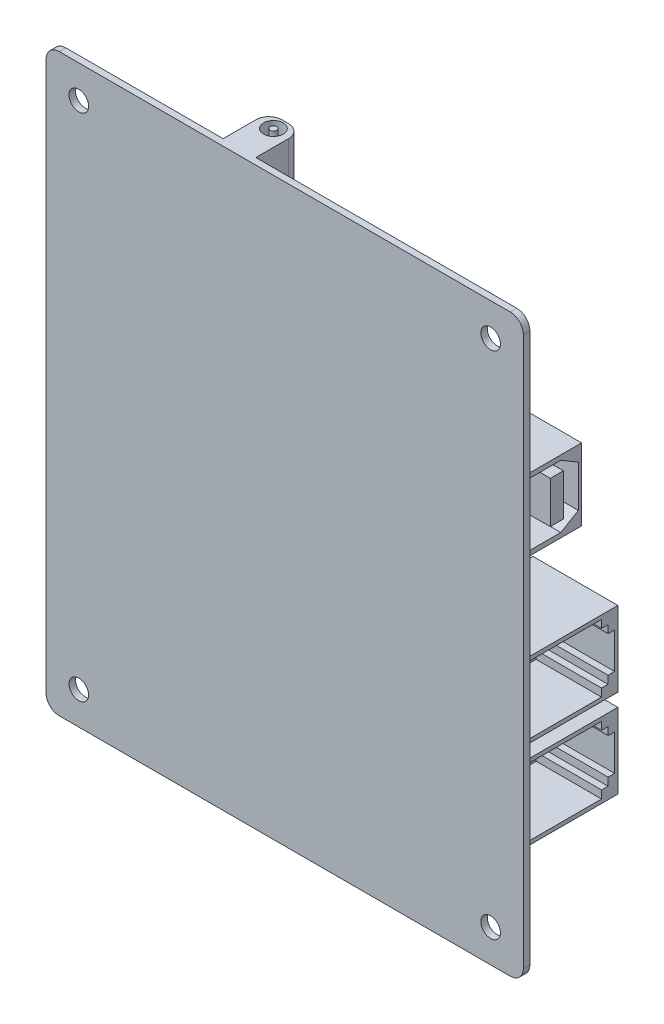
from build123d import *

# Parameters (mm, degrees)
ESQUISSE1_W                  = 73
ESQUISSE1_H                  = 88
ESQUISSE1_R                  = 1.5
CARTE_M_RE_DEPTH             = 1
CONG_2_R                     = 2
ESQUISSE6_W                  = 13
ESQUISSE6_H                  = 11.5
CONNEXIONS_DEPTH             = 14
INT_RIEUR_CONNEXIONS1_DEPTH  = 10
INT_RIEUR_CONNEXIONS_2_DEPTH = 10
ESQUISSE11_W                 = 14
ESQUISSE11_H                 = 11
PORT_USB_DEPTH               = 10
ESQUISSE13_W                 = 2
ESQUISSE13_H                 = 6.398357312
INT_RIEUR_PORT_USB_DEPTH     = 10
ESQUISSE15_R                 = 4
ESQUISSE15_R_2               = 1
BUZZER_DEPTH                 = 7
ESQUISSE16_W                 = 5.32849968
ESQUISSE16_H                 = 12
INTER_DEPTH                  = 5
ESQUISSE19_W                 = 3.3
ESQUISSE19_H                 = 8
INT_RIEUR_INTER_DEPTH        = 5
ESQUISSE20_W                 = 3.3
ESQUISSE20_H                 = 4
CURSEUR_NOIR_INTER_DEPTH     = 7
ESQUISSE23_W                 = 5
ESQUISSE23_H                 = 12.332239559
ALIM_DEPTH                   = 7
CONG_3_R                     = 2
ESQUISSE25_R                 = 1.5
ESQUISSE25_R_2               = 0.5
INT_RIEUR_ALIM_DEPTH         = 8
ESQUISSE27_W                 = 5.8
ESQUISSE27_H                 = 5.8
BASE_BP_DEPTH                = 2
ESQUISSE28_R                 = 1.5
BP_DEPTH                     = 1


with BuildPart() as part:
    # Esquisse1 → Carte m_re (new body)
    with BuildSketch(Plane.XY):
        with Locations((36.5, 44)):
            Rectangle(ESQUISSE1_W, ESQUISSE1_H)
        with Locations((5, 83)):
            Circle(ESQUISSE1_R, mode=Mode.SUBTRACT)
        with Locations(Location((68, 5, 0), (0, 0, 180))):
            Circle(ESQUISSE1_R, mode=Mode.SUBTRACT)
        with Locations(Location((68, 83, 0), (0, 0, 180))):
            Circle(ESQUISSE1_R, mode=Mode.SUBTRACT)
        with Locations((5, 5)):
            Circle(ESQUISSE1_R, mode=Mode.SUBTRACT)
    extrude(amount=CARTE_M_RE_DEPTH)

    # Cong_2
    cong_2_edges = [part.edges().sort_by_distance(p)[0] for p in [
        (0, 88, 0.5),
        (73, 88, 0.5),
        (73, 0, 0.5),
        (0, 0, 0.5),
    ]]
    fillet(cong_2_edges, radius=CONG_2_R)

    # Esquisse6 → Connexions (add)
    with BuildSketch(Plane.XY):
        with Locations((65.965950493, 23.108065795)):
            Rectangle(ESQUISSE6_W, ESQUISSE6_H)
        with Locations((65.965950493, 36.608065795)):
            Rectangle(ESQUISSE6_W, ESQUISSE6_H)
        with Locations((8.316688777, 36.608065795)):
            Rectangle(ESQUISSE6_W, ESQUISSE6_H)
        with Locations((8.316688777, 23.108065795)):
            Rectangle(ESQUISSE6_W, ESQUISSE6_H)
    extrude(amount=-CONNEXIONS_DEPTH)

    # Esquisse10 → Int_rieur connexions1 (cut)
    with BuildSketch(Plane(origin=(72.465950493, 0, 0), x_dir=(0, 0, -1), z_dir=(1, 0, 0))):
        Polygon((13.5, 33.858065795), (13.5, 39.358065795), (12.5, 39.358065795), (12.5, 40.558065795), (11.5, 40.558065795), (11.5, 41.758065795), (0.5, 41.758065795), (0.5, 31.458065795), (11.5, 31.458065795), (11.5, 32.658065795), (12.5, 32.658065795), (12.5, 33.858065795), align=None)
        Polygon((13.5, 20.358065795), (12.5, 20.358065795), (12.5, 19.158065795), (11.5, 19.158065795), (11.5, 17.958065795), (0.5, 17.958065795), (0.5, 28.258065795), (11.5, 28.258065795), (11.5, 27.058065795), (12.5, 27.058065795), (12.5, 25.858065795), (13.5, 25.858065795), align=None)
    extrude(amount=-INT_RIEUR_CONNEXIONS1_DEPTH, mode=Mode.SUBTRACT)

    # Esquisse8 → Int_rieur connexions 2 (cut)
    with BuildSketch(Plane.ZY.offset(-1.816688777)):
        Polygon((-13.5, 25.858065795), (-13.5, 20.358065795), (-12.5, 20.358065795), (-12.5, 19.158065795), (-11.5, 19.158065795), (-11.5, 17.958065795), (-0.5, 17.958065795), (-0.5, 28.258065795), (-11.5, 28.258065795), (-11.5, 27.058065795), (-12.5, 27.058065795), (-12.5, 25.858065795), align=None)
        Polygon((-12.5, 33.858065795), (-12.5, 32.658065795), (-11.5, 32.658065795), (-11.5, 31.458065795), (-0.5, 31.458065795), (-0.5, 41.758065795), (-11.5, 41.758065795), (-11.5, 40.558065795), (-12.5, 40.558065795), (-12.5, 39.358065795), (-13.5, 39.358065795), (-13.5, 33.858065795), align=None)
    extrude(amount=-INT_RIEUR_CONNEXIONS_2_DEPTH, mode=Mode.SUBTRACT)

    # Esquisse11 → Port USB (add)
    with BuildSketch(Plane.XY):
        with Locations((63.915568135, 59.617003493)):
            Rectangle(ESQUISSE11_W, ESQUISSE11_H)
    extrude(amount=-PORT_USB_DEPTH)

    # Esquisse13 → int_rieur Port USB (cut)
    with BuildSketch(Plane(origin=(70.915568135, 0, 0), x_dir=(0, 0, -1), z_dir=(1, 0, 0))):
        Polygon((9.5, 56.417824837), (9.5, 62.816182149), (6.815315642, 64.403230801), (0.798522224, 64.403230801), (0.798522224, 54.830776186), (6.815315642, 54.830776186), align=None)
        with Locations((6.204681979, 59.617003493)):
            Rectangle(ESQUISSE13_W, ESQUISSE13_H, mode=Mode.SUBTRACT)
    extrude(amount=-INT_RIEUR_PORT_USB_DEPTH, mode=Mode.SUBTRACT)

    # Esquisse15 → Buzzer (add)
    with BuildSketch(Plane(origin=(0, 0, 0), x_dir=(-1, 0, 0), z_dir=(0, 0, -1))):
        with Locations((-57.345009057, 6.619073)):
            Circle(ESQUISSE15_R)
        with Locations((-57.345009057, 6.619073)):
            Circle(ESQUISSE15_R_2, mode=Mode.SUBTRACT)
    extrude(amount=BUZZER_DEPTH)

    # Esquisse16 → Inter (add)
    with BuildSketch(Plane(origin=(0, 0, 0), x_dir=(-1, 0, 0), z_dir=(0, 0, -1))):
        with Locations((-4.452887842, 70.163550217)):
            Rectangle(ESQUISSE16_W, ESQUISSE16_H)
    extrude(amount=INTER_DEPTH)

    # Esquisse19 → Int_rieur Inter (cut)
    with BuildSketch(Plane.ZY.offset(-1.788638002)):
        with Locations((-2.35, 69.295841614)):
            Rectangle(ESQUISSE19_W, ESQUISSE19_H)
    extrude(amount=-INT_RIEUR_INTER_DEPTH, mode=Mode.SUBTRACT)

    # Esquisse20 → curseur noir Inter (add)
    with BuildSketch(Plane.ZY.offset(-6.788638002)):
        with Locations((-2.35, 67.295841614)):
            Rectangle(ESQUISSE20_W, ESQUISSE20_H)
    extrude(amount=CURSEUR_NOIR_INTER_DEPTH)

    # Esquisse23 → Alim (add)
    with BuildSketch(Plane.XY):
        with Locations((28.576914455, 81.83388022)):
            Rectangle(ESQUISSE23_W, ESQUISSE23_H)
    extrude(amount=-ALIM_DEPTH)

    # Cong_3
    cong_3_edges = [part.edges().sort_by_distance(p)[0] for p in [
        (26.076914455, 81.83388022, -7),
        (31.076914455, 81.83388022, -7),
    ]]
    fillet(cong_3_edges, radius=CONG_3_R)

    # Esquisse25 → Int_rieur alim (cut)
    with BuildSketch(Plane(origin=(0, 88, 0), x_dir=(1, 0, 0), z_dir=(0, 1, 0))):
        with Locations(Location((28.576914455, 5.195450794, 0), (0, 0, 270))):
            Circle(ESQUISSE25_R)
        with Locations(Location((28.576914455, 5.195450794, 0), (0, 0, 270))):
            Circle(ESQUISSE25_R_2, mode=Mode.SUBTRACT)
    extrude(amount=-INT_RIEUR_ALIM_DEPTH, mode=Mode.SUBTRACT)

    # Esquisse27 → Base BP (add)
    with BuildSketch(Plane.XY):
        with Locations((18.480480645, 6.636303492)):
            Rectangle(ESQUISSE27_W, ESQUISSE27_H)
    extrude(amount=-BASE_BP_DEPTH)

    # Esquisse28 → BP (add)
    with BuildSketch(Plane(origin=(0, 0, -2), x_dir=(-1, 0, 0), z_dir=(0, 0, -1))):
        with Locations((-18.430480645, 6.71336295)):
            Circle(ESQUISSE28_R)
    extrude(amount=BP_DEPTH)


solid = part.part
